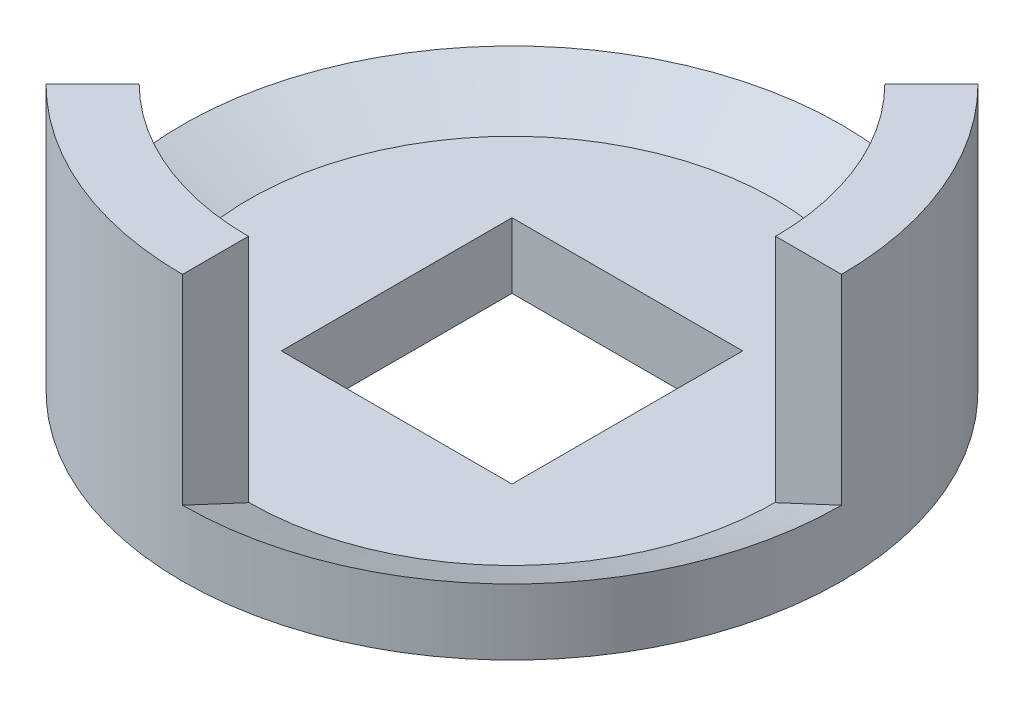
ISO-10303-21;
HEADER;
FILE_DESCRIPTION(('STEP AP214'),'2;1');
FILE_NAME('part.step','',(''),(''),'','','');
FILE_SCHEMA(('AUTOMOTIVE_DESIGN { 1 0 10303 214 1 1 1 1 }'));
ENDSEC;
DATA;
#1=APPLICATION_CONTEXT('core data for automotive mechanical design processes');
#2=APPLICATION_PROTOCOL_DEFINITION('international standard','automotive_design',2000,#1);
#3=PRODUCT_CONTEXT('',#1,'mechanical');
#4=PRODUCT('Part','Part','',(#3));
#5=PRODUCT_RELATED_PRODUCT_CATEGORY('part','',(#4));
#6=PRODUCT_DEFINITION_FORMATION('','',#4);
#7=PRODUCT_DEFINITION_CONTEXT('part definition',#1,'design');
#8=PRODUCT_DEFINITION('design','',#6,#7);
#9=PRODUCT_DEFINITION_SHAPE('','',#8);
#10=(LENGTH_UNIT() NAMED_UNIT(*) SI_UNIT(.MILLI.,.METRE.));
#11=(NAMED_UNIT(*) PLANE_ANGLE_UNIT() SI_UNIT($,.RADIAN.));
#12=(NAMED_UNIT(*) SI_UNIT($,.STERADIAN.) SOLID_ANGLE_UNIT());
#13=UNCERTAINTY_MEASURE_WITH_UNIT(LENGTH_MEASURE(1.E-05),#10,'distance_accuracy_value','');
#14=(GEOMETRIC_REPRESENTATION_CONTEXT(3) GLOBAL_UNCERTAINTY_ASSIGNED_CONTEXT((#13)) GLOBAL_UNIT_ASSIGNED_CONTEXT((#10,
#11,#12)) REPRESENTATION_CONTEXT('',''));
#15=CARTESIAN_POINT('',(0.,0.,0.));
#16=DIRECTION('',(0.,0.,1.));
#17=DIRECTION('',(1.,0.,0.));
#18=AXIS2_PLACEMENT_3D('',#15,#16,#17);
#19=CARTESIAN_POINT('',(0.,0.,0.));
#20=DIRECTION('',(0.,-1.,0.));
#21=DIRECTION('',(0.,0.,-1.));
#22=AXIS2_PLACEMENT_3D('',#19,#20,#21);
#23=PLANE('',#22);
#24=DIRECTION('',(0.,0.,-1.));
#25=VECTOR('',#24,1.);
#26=CARTESIAN_POINT('',(3.5,0.,-3.5));
#27=LINE('',#26,#25);
#28=CARTESIAN_POINT('',(3.5,0.,3.5));
#29=VERTEX_POINT('',#28);
#30=CARTESIAN_POINT('',(3.5,0.,-3.5));
#31=VERTEX_POINT('',#30);
#32=EDGE_CURVE('E177',#29,#31,#27,.T.);
#33=ORIENTED_EDGE('',*,*,#32,.T.);
#34=DIRECTION('',(-1.,0.,0.));
#35=VECTOR('',#34,1.);
#36=CARTESIAN_POINT('',(-3.5,0.,-3.5));
#37=LINE('',#36,#35);
#38=CARTESIAN_POINT('',(-3.5,0.,-3.5));
#39=VERTEX_POINT('',#38);
#40=EDGE_CURVE('E180',#31,#39,#37,.T.);
#41=ORIENTED_EDGE('',*,*,#40,.T.);
#42=DIRECTION('',(0.,0.,1.));
#43=VECTOR('',#42,1.);
#44=CARTESIAN_POINT('',(-3.5,0.,-3.5));
#45=LINE('',#44,#43);
#46=CARTESIAN_POINT('',(-3.5,0.,3.5));
#47=VERTEX_POINT('',#46);
#48=EDGE_CURVE('E184',#39,#47,#45,.T.);
#49=ORIENTED_EDGE('',*,*,#48,.T.);
#50=DIRECTION('',(1.,0.,0.));
#51=VECTOR('',#50,1.);
#52=CARTESIAN_POINT('',(-3.5,0.,3.5));
#53=LINE('',#52,#51);
#54=EDGE_CURVE('E187',#47,#29,#53,.T.);
#55=ORIENTED_EDGE('',*,*,#54,.T.);
#56=EDGE_LOOP('',(#33,#41,#49,#55));
#57=FACE_BOUND('',#56,.T.);
#58=CARTESIAN_POINT('',(0.,0.,0.));
#59=DIRECTION('',(0.,-1.,0.));
#60=DIRECTION('',(0.,0.,-1.));
#61=AXIS2_PLACEMENT_3D('',#58,#59,#60);
#62=CIRCLE('',#61,8.);
#63=CARTESIAN_POINT('',(0.,0.,-8.));
#64=VERTEX_POINT('',#63);
#65=EDGE_CURVE('E217',#64,#64,#62,.T.);
#66=ORIENTED_EDGE('',*,*,#65,.T.);
#67=EDGE_LOOP('',(#66));
#68=FACE_BOUND('',#67,.T.);
#69=ADVANCED_FACE('F34',(#57,#68),#23,.T.);
#70=CARTESIAN_POINT('',(0.,0.,0.));
#71=DIRECTION('',(0.,1.,0.));
#72=DIRECTION('',(0.,0.,1.));
#73=AXIS2_PLACEMENT_3D('',#70,#71,#72);
#74=CONICAL_SURFACE('',#73,8.,1.13446401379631);
#75=CARTESIAN_POINT('',(0.,0.93261531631,0.));
#76=DIRECTION('',(0.,-1.,0.));
#77=DIRECTION('',(0.,0.,-1.));
#78=AXIS2_PLACEMENT_3D('',#75,#76,#77);
#79=CIRCLE('',#78,10.);
#80=CARTESIAN_POINT('',(0.,0.93261531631,-10.));
#81=VERTEX_POINT('',#80);
#82=EDGE_CURVE('E214',#81,#81,#79,.T.);
#83=ORIENTED_EDGE('',*,*,#82,.T.);
#84=EDGE_LOOP('',(#83));
#85=FACE_BOUND('',#84,.T.);
#86=ORIENTED_EDGE('',*,*,#65,.F.);
#87=EDGE_LOOP('',(#86));
#88=FACE_BOUND('',#87,.T.);
#89=ADVANCED_FACE('F261',(#85,#88),#74,.T.);
#90=CARTESIAN_POINT('',(0.,0.,0.));
#91=DIRECTION('',(0.,-1.,0.));
#92=DIRECTION('',(0.,0.,-1.));
#93=AXIS2_PLACEMENT_3D('',#90,#91,#92);
#94=CYLINDRICAL_SURFACE('',#93,10.);
#95=CARTESIAN_POINT('',(0.,2.93261531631,0.));
#96=DIRECTION('',(0.,-1.,0.));
#97=DIRECTION('',(0.,0.,-1.));
#98=AXIS2_PLACEMENT_3D('',#95,#96,#97);
#99=CIRCLE('',#98,10.);
#100=CARTESIAN_POINT('',(10.,2.93261531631,0.));
#101=VERTEX_POINT('',#100);
#102=CARTESIAN_POINT('',(0.,2.93261531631,10.));
#103=VERTEX_POINT('',#102);
#104=EDGE_CURVE('E212',#101,#103,#99,.T.);
#105=ORIENTED_EDGE('',*,*,#104,.T.);
#106=DIRECTION('',(0.,-1.,0.));
#107=VECTOR('',#106,1.);
#108=CARTESIAN_POINT('',(0.,9.,10.));
#109=LINE('',#108,#107);
#110=CARTESIAN_POINT('',(0.,9.,10.));
#111=VERTEX_POINT('',#110);
#112=EDGE_CURVE('E142',#111,#103,#109,.T.);
#113=ORIENTED_EDGE('',*,*,#112,.F.);
#114=CARTESIAN_POINT('',(0.,9.,0.));
#115=DIRECTION('',(0.,-1.,0.));
#116=DIRECTION('',(0.,0.,-1.));
#117=AXIS2_PLACEMENT_3D('',#114,#115,#116);
#118=CIRCLE('',#117,10.);
#119=CARTESIAN_POINT('',(-7.07106781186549,9.,7.07106781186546));
#120=VERTEX_POINT('',#119);
#121=EDGE_CURVE('E133',#111,#120,#118,.T.);
#122=ORIENTED_EDGE('',*,*,#121,.T.);
#123=DIRECTION('',(0.,-1.,0.));
#124=VECTOR('',#123,1.);
#125=CARTESIAN_POINT('',(-7.07106781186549,9.,7.07106781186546));
#126=LINE('',#125,#124);
#127=CARTESIAN_POINT('',(-7.07106781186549,2.93261531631,7.07106781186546));
#128=VERTEX_POINT('',#127);
#129=EDGE_CURVE('E118',#120,#128,#126,.T.);
#130=ORIENTED_EDGE('',*,*,#129,.T.);
#131=CARTESIAN_POINT('',(7.07106781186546,2.93261531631,-7.07106781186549));
#132=VERTEX_POINT('',#131);
#133=EDGE_CURVE('E211',#128,#132,#99,.T.);
#134=ORIENTED_EDGE('',*,*,#133,.T.);
#135=DIRECTION('',(0.,-1.,0.));
#136=VECTOR('',#135,1.);
#137=CARTESIAN_POINT('',(7.07106781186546,9.,-7.07106781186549));
#138=LINE('',#137,#136);
#139=CARTESIAN_POINT('',(7.07106781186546,9.,-7.07106781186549));
#140=VERTEX_POINT('',#139);
#141=EDGE_CURVE('E165',#140,#132,#138,.T.);
#142=ORIENTED_EDGE('',*,*,#141,.F.);
#143=CARTESIAN_POINT('',(0.,9.,0.));
#144=DIRECTION('',(0.,-1.,0.));
#145=DIRECTION('',(0.,0.,-1.));
#146=AXIS2_PLACEMENT_3D('',#143,#144,#145);
#147=CIRCLE('',#146,10.);
#148=CARTESIAN_POINT('',(10.,9.,0.));
#149=VERTEX_POINT('',#148);
#150=EDGE_CURVE('E148',#140,#149,#147,.T.);
#151=ORIENTED_EDGE('',*,*,#150,.T.);
#152=DIRECTION('',(0.,-1.,0.));
#153=VECTOR('',#152,1.);
#154=CARTESIAN_POINT('',(10.,9.,0.));
#155=LINE('',#154,#153);
#156=EDGE_CURVE('E164',#149,#101,#155,.T.);
#157=ORIENTED_EDGE('',*,*,#156,.T.);
#158=EDGE_LOOP('',(#105,#113,#122,#130,#134,#142,#151,#157));
#159=FACE_BOUND('',#158,.T.);
#160=ORIENTED_EDGE('',*,*,#82,.F.);
#161=EDGE_LOOP('',(#160));
#162=FACE_BOUND('',#161,.T.);
#163=ADVANCED_FACE('F139',(#159,#162),#94,.T.);
#164=CARTESIAN_POINT('',(0.,2.93261531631,0.));
#165=DIRECTION('',(0.,1.,0.));
#166=DIRECTION('',(0.,0.,1.));
#167=AXIS2_PLACEMENT_3D('',#164,#165,#166);
#168=CONICAL_SURFACE('',#167,10.,1.13446401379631);
#169=DIRECTION('',(0.,-0.422618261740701,-0.906307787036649));
#170=VECTOR('',#169,1.);
#171=CARTESIAN_POINT('',(0.,-1.73046126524,0.));
#172=LINE('',#171,#170);
#173=CARTESIAN_POINT('',(0.,2.,8.));
#174=VERTEX_POINT('',#173);
#175=EDGE_CURVE('E11',#103,#174,#172,.T.);
#176=ORIENTED_EDGE('',*,*,#175,.F.);
#177=ORIENTED_EDGE('',*,*,#104,.F.);
#178=DIRECTION('',(0.906307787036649,0.422618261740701,0.));
#179=VECTOR('',#178,1.);
#180=CARTESIAN_POINT('',(0.,-1.73046126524,0.));
#181=LINE('',#180,#179);
#182=CARTESIAN_POINT('',(8.,2.,0.));
#183=VERTEX_POINT('',#182);
#184=EDGE_CURVE('E220',#183,#101,#181,.T.);
#185=ORIENTED_EDGE('',*,*,#184,.F.);
#186=CARTESIAN_POINT('',(0.,2.,0.));
#187=DIRECTION('',(0.,1.,0.));
#188=DIRECTION('',(0.,0.,1.));
#189=AXIS2_PLACEMENT_3D('',#186,#187,#188);
#190=CIRCLE('',#189,8.);
#191=CARTESIAN_POINT('',(5.65685424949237,2.,-5.65685424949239));
#192=VERTEX_POINT('',#191);
#193=EDGE_CURVE('E223',#192,#183,#190,.F.);
#194=ORIENTED_EDGE('',*,*,#193,.F.);
#195=DIRECTION('',(-0.640856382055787,-0.422618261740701,0.640856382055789));
#196=VECTOR('',#195,1.);
#197=CARTESIAN_POINT('',(0.,-1.73046126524,0.));
#198=LINE('',#197,#196);
#199=EDGE_CURVE('E226',#132,#192,#198,.T.);
#200=ORIENTED_EDGE('',*,*,#199,.F.);
#201=ORIENTED_EDGE('',*,*,#133,.F.);
#202=DIRECTION('',(-0.640856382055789,0.422618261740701,0.640856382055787));
#203=VECTOR('',#202,1.);
#204=CARTESIAN_POINT('',(0.,-1.73046126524,0.));
#205=LINE('',#204,#203);
#206=CARTESIAN_POINT('',(-5.65685424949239,2.,5.65685424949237));
#207=VERTEX_POINT('',#206);
#208=EDGE_CURVE('E51',#207,#128,#205,.T.);
#209=ORIENTED_EDGE('',*,*,#208,.F.);
#210=CARTESIAN_POINT('',(0.,2.,0.));
#211=DIRECTION('',(0.,1.,0.));
#212=DIRECTION('',(0.,0.,1.));
#213=AXIS2_PLACEMENT_3D('',#210,#211,#212);
#214=CIRCLE('',#213,8.);
#215=EDGE_CURVE('E41',#174,#207,#214,.F.);
#216=ORIENTED_EDGE('',*,*,#215,.F.);
#217=EDGE_LOOP('',(#176,#177,#185,#194,#200,#201,#209,#216));
#218=FACE_BOUND('',#217,.T.);
#219=CARTESIAN_POINT('',(0.,1.98942622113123,0.));
#220=DIRECTION('',(0.,-1.,0.));
#221=DIRECTION('',(0.,0.,-1.));
#222=AXIS2_PLACEMENT_3D('',#219,#220,#221);
#223=CIRCLE('',#222,7.97732445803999);
#224=CARTESIAN_POINT('',(0.,1.98942622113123,-7.97732445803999));
#225=VERTEX_POINT('',#224);
#226=EDGE_CURVE('E202',#225,#225,#223,.T.);
#227=ORIENTED_EDGE('',*,*,#226,.T.);
#228=EDGE_LOOP('',(#227));
#229=FACE_BOUND('',#228,.T.);
#230=ADVANCED_FACE('F233',(#218,#229),#168,.F.);
#231=CARTESIAN_POINT('',(7.97732445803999,1.98942622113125,0.));
#232=DIRECTION('',(0.,1.,0.));
#233=DIRECTION('',(0.,0.,1.));
#234=AXIS2_PLACEMENT_3D('',#231,#232,#233);
#235=PLANE('',#234);
#236=DIRECTION('',(0.,0.,-1.));
#237=VECTOR('',#236,1.);
#238=CARTESIAN_POINT('',(3.5,1.98942622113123,-3.5));
#239=LINE('',#238,#237);
#240=CARTESIAN_POINT('',(3.5,1.98942622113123,3.5));
#241=VERTEX_POINT('',#240);
#242=CARTESIAN_POINT('',(3.5,1.98942622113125,-3.5));
#243=VERTEX_POINT('',#242);
#244=EDGE_CURVE('E168',#241,#243,#239,.T.);
#245=ORIENTED_EDGE('',*,*,#244,.F.);
#246=DIRECTION('',(1.,0.,0.));
#247=VECTOR('',#246,1.);
#248=CARTESIAN_POINT('',(-3.5,1.98942622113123,3.5));
#249=LINE('',#248,#247);
#250=CARTESIAN_POINT('',(-3.5,1.98942622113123,3.5));
#251=VERTEX_POINT('',#250);
#252=EDGE_CURVE('E181',#251,#241,#249,.T.);
#253=ORIENTED_EDGE('',*,*,#252,.F.);
#254=DIRECTION('',(0.,0.,1.));
#255=VECTOR('',#254,1.);
#256=CARTESIAN_POINT('',(-3.5,1.98942622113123,-3.5));
#257=LINE('',#256,#255);
#258=CARTESIAN_POINT('',(-3.5,1.98942622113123,-3.5));
#259=VERTEX_POINT('',#258);
#260=EDGE_CURVE('E195',#259,#251,#257,.T.);
#261=ORIENTED_EDGE('',*,*,#260,.F.);
#262=DIRECTION('',(-1.,0.,0.));
#263=VECTOR('',#262,1.);
#264=CARTESIAN_POINT('',(-3.5,1.98942622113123,-3.5));
#265=LINE('',#264,#263);
#266=EDGE_CURVE('E192',#243,#259,#265,.T.);
#267=ORIENTED_EDGE('',*,*,#266,.F.);
#268=EDGE_LOOP('',(#245,#253,#261,#267));
#269=FACE_BOUND('',#268,.T.);
#270=ORIENTED_EDGE('',*,*,#226,.F.);
#271=EDGE_LOOP('',(#270));
#272=FACE_BOUND('',#271,.T.);
#273=ADVANCED_FACE('F284',(#269,#272),#235,.T.);
#274=CARTESIAN_POINT('',(3.5,0.,-3.5));
#275=DIRECTION('',(1.,0.,0.));
#276=DIRECTION('',(0.,0.,-1.));
#277=AXIS2_PLACEMENT_3D('',#274,#275,#276);
#278=PLANE('',#277);
#279=ORIENTED_EDGE('',*,*,#244,.T.);
#280=DIRECTION('',(0.,1.,0.));
#281=VECTOR('',#280,1.);
#282=CARTESIAN_POINT('',(3.5,0.,-3.5));
#283=LINE('',#282,#281);
#284=EDGE_CURVE('E190',#31,#243,#283,.T.);
#285=ORIENTED_EDGE('',*,*,#284,.F.);
#286=ORIENTED_EDGE('',*,*,#32,.F.);
#287=DIRECTION('',(0.,1.,0.));
#288=VECTOR('',#287,1.);
#289=CARTESIAN_POINT('',(3.5,0.,3.5));
#290=LINE('',#289,#288);
#291=EDGE_CURVE('E200',#29,#241,#290,.T.);
#292=ORIENTED_EDGE('',*,*,#291,.T.);
#293=EDGE_LOOP('',(#279,#285,#286,#292));
#294=FACE_BOUND('',#293,.T.);
#295=ADVANCED_FACE('F274',(#294),#278,.F.);
#296=CARTESIAN_POINT('',(-3.5,0.,3.5));
#297=DIRECTION('',(0.,0.,1.));
#298=DIRECTION('',(1.,0.,0.));
#299=AXIS2_PLACEMENT_3D('',#296,#297,#298);
#300=PLANE('',#299);
#301=ORIENTED_EDGE('',*,*,#252,.T.);
#302=ORIENTED_EDGE('',*,*,#291,.F.);
#303=ORIENTED_EDGE('',*,*,#54,.F.);
#304=DIRECTION('',(0.,1.,0.));
#305=VECTOR('',#304,1.);
#306=CARTESIAN_POINT('',(-3.5,0.,3.5));
#307=LINE('',#306,#305);
#308=EDGE_CURVE('E203',#47,#251,#307,.T.);
#309=ORIENTED_EDGE('',*,*,#308,.T.);
#310=EDGE_LOOP('',(#301,#302,#303,#309));
#311=FACE_BOUND('',#310,.T.);
#312=ADVANCED_FACE('F282',(#311),#300,.F.);
#313=CARTESIAN_POINT('',(-3.5,0.,-3.5));
#314=DIRECTION('',(-1.,0.,0.));
#315=DIRECTION('',(0.,0.,1.));
#316=AXIS2_PLACEMENT_3D('',#313,#314,#315);
#317=PLANE('',#316);
#318=ORIENTED_EDGE('',*,*,#260,.T.);
#319=ORIENTED_EDGE('',*,*,#308,.F.);
#320=ORIENTED_EDGE('',*,*,#48,.F.);
#321=DIRECTION('',(0.,1.,0.));
#322=VECTOR('',#321,1.);
#323=CARTESIAN_POINT('',(-3.5,0.,-3.5));
#324=LINE('',#323,#322);
#325=EDGE_CURVE('E205',#39,#259,#324,.T.);
#326=ORIENTED_EDGE('',*,*,#325,.T.);
#327=EDGE_LOOP('',(#318,#319,#320,#326));
#328=FACE_BOUND('',#327,.T.);
#329=ADVANCED_FACE('F256',(#328),#317,.F.);
#330=CARTESIAN_POINT('',(-3.5,0.,-3.5));
#331=DIRECTION('',(0.,0.,-1.));
#332=DIRECTION('',(-1.,0.,0.));
#333=AXIS2_PLACEMENT_3D('',#330,#331,#332);
#334=PLANE('',#333);
#335=ORIENTED_EDGE('',*,*,#266,.T.);
#336=ORIENTED_EDGE('',*,*,#325,.F.);
#337=ORIENTED_EDGE('',*,*,#40,.F.);
#338=ORIENTED_EDGE('',*,*,#284,.T.);
#339=EDGE_LOOP('',(#335,#336,#337,#338));
#340=FACE_BOUND('',#339,.T.);
#341=ADVANCED_FACE('F249',(#340),#334,.F.);
#342=CARTESIAN_POINT('',(7.07106781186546,9.,-7.07106781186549));
#343=DIRECTION('',(-0.707106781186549,0.,-0.707106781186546));
#344=DIRECTION('',(-0.707106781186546,0.,0.707106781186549));
#345=AXIS2_PLACEMENT_3D('',#342,#343,#344);
#346=PLANE('',#345);
#347=ORIENTED_EDGE('',*,*,#141,.T.);
#348=ORIENTED_EDGE('',*,*,#199,.T.);
#349=DIRECTION('',(0.,-1.,0.));
#350=VECTOR('',#349,1.);
#351=CARTESIAN_POINT('',(5.65685424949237,9.,-5.65685424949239));
#352=LINE('',#351,#350);
#353=CARTESIAN_POINT('',(5.65685424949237,9.,-5.65685424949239));
#354=VERTEX_POINT('',#353);
#355=EDGE_CURVE('E169',#354,#192,#352,.T.);
#356=ORIENTED_EDGE('',*,*,#355,.F.);
#357=DIRECTION('',(0.707106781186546,0.,-0.707106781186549));
#358=VECTOR('',#357,1.);
#359=CARTESIAN_POINT('',(7.07106781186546,9.,-7.07106781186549));
#360=LINE('',#359,#358);
#361=EDGE_CURVE('E161',#354,#140,#360,.T.);
#362=ORIENTED_EDGE('',*,*,#361,.T.);
#363=EDGE_LOOP('',(#347,#348,#356,#362));
#364=FACE_BOUND('',#363,.T.);
#365=ADVANCED_FACE('F247',(#364),#346,.T.);
#366=CARTESIAN_POINT('',(0.,9.,0.));
#367=DIRECTION('',(0.,-1.,0.));
#368=DIRECTION('',(0.,0.,-1.));
#369=AXIS2_PLACEMENT_3D('',#366,#367,#368);
#370=CYLINDRICAL_SURFACE('',#369,8.);
#371=ORIENTED_EDGE('',*,*,#355,.T.);
#372=ORIENTED_EDGE('',*,*,#193,.T.);
#373=DIRECTION('',(0.,-1.,0.));
#374=VECTOR('',#373,1.);
#375=CARTESIAN_POINT('',(8.,9.,0.));
#376=LINE('',#375,#374);
#377=CARTESIAN_POINT('',(8.,9.,0.));
#378=VERTEX_POINT('',#377);
#379=EDGE_CURVE('E172',#378,#183,#376,.T.);
#380=ORIENTED_EDGE('',*,*,#379,.F.);
#381=CARTESIAN_POINT('',(0.,9.,0.));
#382=DIRECTION('',(0.,1.,0.));
#383=DIRECTION('',(0.,0.,-1.));
#384=AXIS2_PLACEMENT_3D('',#381,#382,#383);
#385=CIRCLE('',#384,8.);
#386=EDGE_CURVE('E158',#378,#354,#385,.T.);
#387=ORIENTED_EDGE('',*,*,#386,.T.);
#388=EDGE_LOOP('',(#371,#372,#380,#387));
#389=FACE_BOUND('',#388,.T.);
#390=ADVANCED_FACE('F244',(#389),#370,.F.);
#391=CARTESIAN_POINT('',(10.,9.,0.));
#392=DIRECTION('',(0.,0.,1.));
#393=DIRECTION('',(1.,0.,0.));
#394=AXIS2_PLACEMENT_3D('',#391,#392,#393);
#395=PLANE('',#394);
#396=ORIENTED_EDGE('',*,*,#379,.T.);
#397=ORIENTED_EDGE('',*,*,#184,.T.);
#398=ORIENTED_EDGE('',*,*,#156,.F.);
#399=DIRECTION('',(-1.,0.,0.));
#400=VECTOR('',#399,1.);
#401=CARTESIAN_POINT('',(10.,9.,0.));
#402=LINE('',#401,#400);
#403=EDGE_CURVE('E155',#149,#378,#402,.T.);
#404=ORIENTED_EDGE('',*,*,#403,.T.);
#405=EDGE_LOOP('',(#396,#397,#398,#404));
#406=FACE_BOUND('',#405,.T.);
#407=ADVANCED_FACE('F238',(#406),#395,.T.);
#408=CARTESIAN_POINT('',(0.,9.,0.));
#409=DIRECTION('',(0.,-1.,0.));
#410=DIRECTION('',(0.,0.,-1.));
#411=AXIS2_PLACEMENT_3D('',#408,#409,#410);
#412=PLANE('',#411);
#413=ORIENTED_EDGE('',*,*,#150,.F.);
#414=ORIENTED_EDGE('',*,*,#361,.F.);
#415=ORIENTED_EDGE('',*,*,#386,.F.);
#416=ORIENTED_EDGE('',*,*,#403,.F.);
#417=EDGE_LOOP('',(#413,#414,#415,#416));
#418=FACE_BOUND('',#417,.T.);
#419=ADVANCED_FACE('F241',(#418),#412,.F.);
#420=CARTESIAN_POINT('',(0.,9.,10.));
#421=DIRECTION('',(1.,0.,0.));
#422=DIRECTION('',(0.,0.,-1.));
#423=AXIS2_PLACEMENT_3D('',#420,#421,#422);
#424=PLANE('',#423);
#425=ORIENTED_EDGE('',*,*,#112,.T.);
#426=ORIENTED_EDGE('',*,*,#175,.T.);
#427=DIRECTION('',(0.,-1.,0.));
#428=VECTOR('',#427,1.);
#429=CARTESIAN_POINT('',(0.,9.,8.));
#430=LINE('',#429,#428);
#431=CARTESIAN_POINT('',(0.,9.,8.));
#432=VERTEX_POINT('',#431);
#433=EDGE_CURVE('E149',#432,#174,#430,.T.);
#434=ORIENTED_EDGE('',*,*,#433,.F.);
#435=DIRECTION('',(0.,0.,1.));
#436=VECTOR('',#435,1.);
#437=CARTESIAN_POINT('',(0.,9.,10.));
#438=LINE('',#437,#436);
#439=EDGE_CURVE('E126',#432,#111,#438,.T.);
#440=ORIENTED_EDGE('',*,*,#439,.T.);
#441=EDGE_LOOP('',(#425,#426,#434,#440));
#442=FACE_BOUND('',#441,.T.);
#443=ADVANCED_FACE('F232',(#442),#424,.T.);
#444=CARTESIAN_POINT('',(0.,9.,0.));
#445=DIRECTION('',(0.,-1.,0.));
#446=DIRECTION('',(0.,0.,-1.));
#447=AXIS2_PLACEMENT_3D('',#444,#445,#446);
#448=CYLINDRICAL_SURFACE('',#447,8.);
#449=ORIENTED_EDGE('',*,*,#433,.T.);
#450=ORIENTED_EDGE('',*,*,#215,.T.);
#451=DIRECTION('',(0.,-1.,0.));
#452=VECTOR('',#451,1.);
#453=CARTESIAN_POINT('',(-5.65685424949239,9.,5.65685424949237));
#454=LINE('',#453,#452);
#455=CARTESIAN_POINT('',(-5.65685424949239,9.,5.65685424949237));
#456=VERTEX_POINT('',#455);
#457=EDGE_CURVE('E125',#456,#207,#454,.T.);
#458=ORIENTED_EDGE('',*,*,#457,.F.);
#459=CARTESIAN_POINT('',(0.,9.,0.));
#460=DIRECTION('',(0.,1.,0.));
#461=DIRECTION('',(0.,0.,-1.));
#462=AXIS2_PLACEMENT_3D('',#459,#460,#461);
#463=CIRCLE('',#462,8.);
#464=EDGE_CURVE('E136',#456,#432,#463,.T.);
#465=ORIENTED_EDGE('',*,*,#464,.T.);
#466=EDGE_LOOP('',(#449,#450,#458,#465));
#467=FACE_BOUND('',#466,.T.);
#468=ADVANCED_FACE('F230',(#467),#448,.F.);
#469=CARTESIAN_POINT('',(-7.07106781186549,9.,7.07106781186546));
#470=DIRECTION('',(-0.707106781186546,0.,-0.707106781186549));
#471=DIRECTION('',(-0.707106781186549,0.,0.707106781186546));
#472=AXIS2_PLACEMENT_3D('',#469,#470,#471);
#473=PLANE('',#472);
#474=ORIENTED_EDGE('',*,*,#457,.T.);
#475=ORIENTED_EDGE('',*,*,#208,.T.);
#476=ORIENTED_EDGE('',*,*,#129,.F.);
#477=DIRECTION('',(0.707106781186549,0.,-0.707106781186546));
#478=VECTOR('',#477,1.);
#479=CARTESIAN_POINT('',(-7.07106781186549,9.,7.07106781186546));
#480=LINE('',#479,#478);
#481=EDGE_CURVE('E122',#120,#456,#480,.T.);
#482=ORIENTED_EDGE('',*,*,#481,.T.);
#483=EDGE_LOOP('',(#474,#475,#476,#482));
#484=FACE_BOUND('',#483,.T.);
#485=ADVANCED_FACE('F121',(#484),#473,.T.);
#486=CARTESIAN_POINT('',(0.,9.,0.));
#487=DIRECTION('',(0.,-1.,0.));
#488=DIRECTION('',(0.,0.,-1.));
#489=AXIS2_PLACEMENT_3D('',#486,#487,#488);
#490=PLANE('',#489);
#491=ORIENTED_EDGE('',*,*,#121,.F.);
#492=ORIENTED_EDGE('',*,*,#439,.F.);
#493=ORIENTED_EDGE('',*,*,#464,.F.);
#494=ORIENTED_EDGE('',*,*,#481,.F.);
#495=EDGE_LOOP('',(#491,#492,#493,#494));
#496=FACE_BOUND('',#495,.T.);
#497=ADVANCED_FACE('F131',(#496),#490,.F.);
#498=CLOSED_SHELL('',(#69,#89,#163,#230,#273,#295,#312,#329,#341,#365,#390,#407,#419,#443,#468,
#485,#497));
#499=MANIFOLD_SOLID_BREP('B2',#498);
#500=ADVANCED_BREP_SHAPE_REPRESENTATION('',(#18,#499),#14);
#501=SHAPE_DEFINITION_REPRESENTATION(#9,#500);
ENDSEC;
END-ISO-10303-21;
